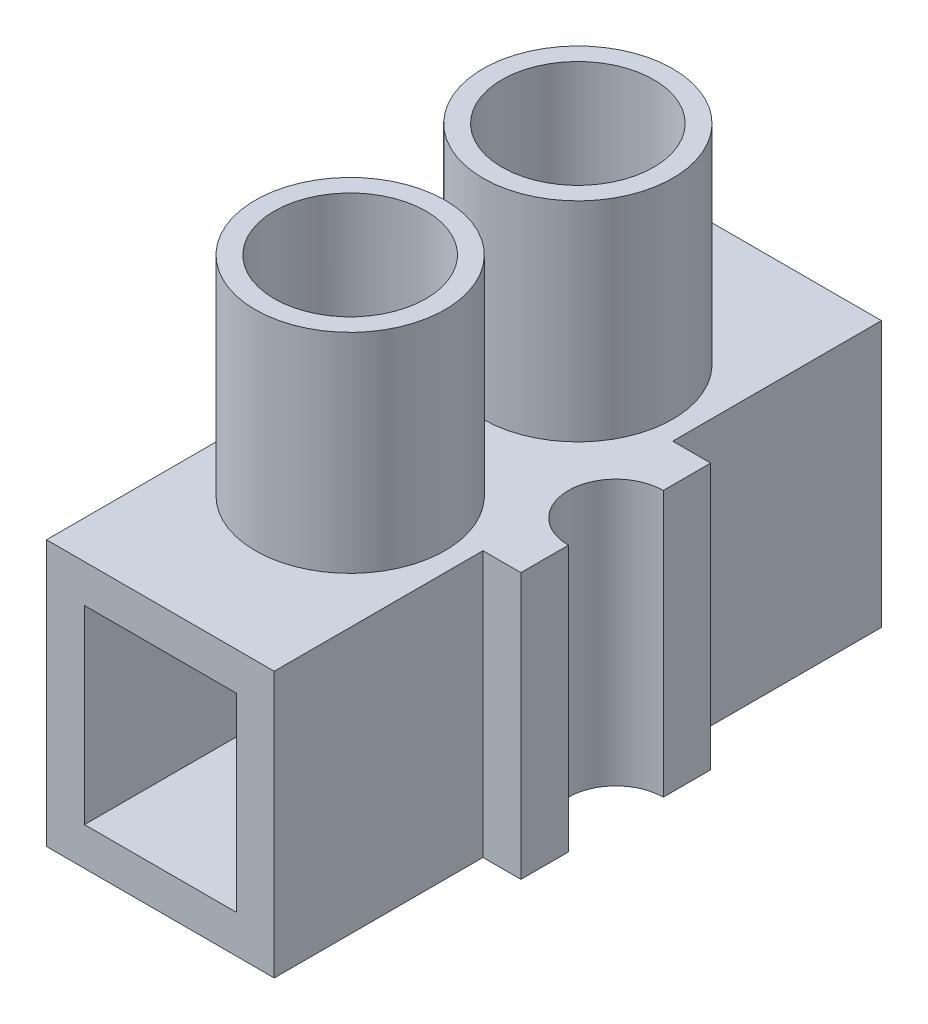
ISO-10303-21;
HEADER;
FILE_DESCRIPTION(('STEP AP214'),'2;1');
FILE_NAME('part.step','',(''),(''),'','','');
FILE_SCHEMA(('AUTOMOTIVE_DESIGN { 1 0 10303 214 1 1 1 1 }'));
ENDSEC;
DATA;
#1=APPLICATION_CONTEXT('core data for automotive mechanical design processes');
#2=APPLICATION_PROTOCOL_DEFINITION('international standard','automotive_design',2000,#1);
#3=PRODUCT_CONTEXT('',#1,'mechanical');
#4=PRODUCT('Part','Part','',(#3));
#5=PRODUCT_RELATED_PRODUCT_CATEGORY('part','',(#4));
#6=PRODUCT_DEFINITION_FORMATION('','',#4);
#7=PRODUCT_DEFINITION_CONTEXT('part definition',#1,'design');
#8=PRODUCT_DEFINITION('design','',#6,#7);
#9=PRODUCT_DEFINITION_SHAPE('','',#8);
#10=(LENGTH_UNIT() NAMED_UNIT(*) SI_UNIT(.MILLI.,.METRE.));
#11=(NAMED_UNIT(*) PLANE_ANGLE_UNIT() SI_UNIT($,.RADIAN.));
#12=(NAMED_UNIT(*) SI_UNIT($,.STERADIAN.) SOLID_ANGLE_UNIT());
#13=UNCERTAINTY_MEASURE_WITH_UNIT(LENGTH_MEASURE(1.E-05),#10,'distance_accuracy_value','');
#14=(GEOMETRIC_REPRESENTATION_CONTEXT(3) GLOBAL_UNCERTAINTY_ASSIGNED_CONTEXT((#13)) GLOBAL_UNIT_ASSIGNED_CONTEXT((#10,
#11,#12)) REPRESENTATION_CONTEXT('',''));
#15=CARTESIAN_POINT('',(0.,0.,0.));
#16=DIRECTION('',(0.,0.,1.));
#17=DIRECTION('',(1.,0.,0.));
#18=AXIS2_PLACEMENT_3D('',#15,#16,#17);
#19=CARTESIAN_POINT('',(3.,7.,-2.5));
#20=DIRECTION('',(-1.,0.,0.));
#21=DIRECTION('',(0.,0.,1.));
#22=AXIS2_PLACEMENT_3D('',#19,#20,#21);
#23=PLANE('',#22);
#24=DIRECTION('',(0.,0.,-1.));
#25=VECTOR('',#24,1.);
#26=CARTESIAN_POINT('',(3.,0.,-2.5));
#27=LINE('',#26,#25);
#28=CARTESIAN_POINT('',(3.,0.,-2.5));
#29=VERTEX_POINT('',#28);
#30=CARTESIAN_POINT('',(3.,0.,-8.));
#31=VERTEX_POINT('',#30);
#32=EDGE_CURVE('E200',#29,#31,#27,.T.);
#33=ORIENTED_EDGE('',*,*,#32,.T.);
#34=DIRECTION('',(0.,-1.,0.));
#35=VECTOR('',#34,1.);
#36=CARTESIAN_POINT('',(3.,7.,-8.));
#37=LINE('',#36,#35);
#38=CARTESIAN_POINT('',(3.,7.,-8.));
#39=VERTEX_POINT('',#38);
#40=EDGE_CURVE('E311',#39,#31,#37,.T.);
#41=ORIENTED_EDGE('',*,*,#40,.F.);
#42=DIRECTION('',(0.,0.,-1.));
#43=VECTOR('',#42,1.);
#44=CARTESIAN_POINT('',(3.,7.,-2.5));
#45=LINE('',#44,#43);
#46=CARTESIAN_POINT('',(3.,7.,-2.5));
#47=VERTEX_POINT('',#46);
#48=EDGE_CURVE('E201',#47,#39,#45,.T.);
#49=ORIENTED_EDGE('',*,*,#48,.F.);
#50=DIRECTION('',(0.,-1.,0.));
#51=VECTOR('',#50,1.);
#52=CARTESIAN_POINT('',(3.,7.,-2.5));
#53=LINE('',#52,#51);
#54=EDGE_CURVE('E235',#47,#29,#53,.T.);
#55=ORIENTED_EDGE('',*,*,#54,.T.);
#56=EDGE_LOOP('',(#33,#41,#49,#55));
#57=FACE_BOUND('',#56,.T.);
#58=ADVANCED_FACE('F37',(#57),#23,.F.);
#59=CARTESIAN_POINT('',(3.,7.,-8.));
#60=DIRECTION('',(0.,0.,1.));
#61=DIRECTION('',(1.,0.,0.));
#62=AXIS2_PLACEMENT_3D('',#59,#60,#61);
#63=PLANE('',#62);
#64=DIRECTION('',(-1.,0.,0.));
#65=VECTOR('',#64,1.);
#66=CARTESIAN_POINT('',(3.,6.,-8.));
#67=LINE('',#66,#65);
#68=CARTESIAN_POINT('',(2.,6.,-8.));
#69=VERTEX_POINT('',#68);
#70=CARTESIAN_POINT('',(-2.,6.,-8.));
#71=VERTEX_POINT('',#70);
#72=EDGE_CURVE('E189',#69,#71,#67,.T.);
#73=ORIENTED_EDGE('',*,*,#72,.T.);
#74=DIRECTION('',(0.,-1.,0.));
#75=VECTOR('',#74,1.);
#76=CARTESIAN_POINT('',(-2.,7.,-8.));
#77=LINE('',#76,#75);
#78=CARTESIAN_POINT('',(-2.,1.,-8.));
#79=VERTEX_POINT('',#78);
#80=EDGE_CURVE('E181',#71,#79,#77,.T.);
#81=ORIENTED_EDGE('',*,*,#80,.T.);
#82=DIRECTION('',(1.,0.,0.));
#83=VECTOR('',#82,1.);
#84=CARTESIAN_POINT('',(3.,1.,-8.));
#85=LINE('',#84,#83);
#86=CARTESIAN_POINT('',(2.,1.,-8.));
#87=VERTEX_POINT('',#86);
#88=EDGE_CURVE('E170',#79,#87,#85,.T.);
#89=ORIENTED_EDGE('',*,*,#88,.T.);
#90=DIRECTION('',(0.,1.,0.));
#91=VECTOR('',#90,1.);
#92=CARTESIAN_POINT('',(2.,7.,-8.));
#93=LINE('',#92,#91);
#94=EDGE_CURVE('E175',#87,#69,#93,.T.);
#95=ORIENTED_EDGE('',*,*,#94,.T.);
#96=EDGE_LOOP('',(#73,#81,#89,#95));
#97=FACE_BOUND('',#96,.T.);
#98=DIRECTION('',(-1.,0.,0.));
#99=VECTOR('',#98,1.);
#100=CARTESIAN_POINT('',(3.,0.,-8.));
#101=LINE('',#100,#99);
#102=CARTESIAN_POINT('',(-3.,0.,-8.));
#103=VERTEX_POINT('',#102);
#104=EDGE_CURVE('E238',#31,#103,#101,.T.);
#105=ORIENTED_EDGE('',*,*,#104,.T.);
#106=DIRECTION('',(0.,-1.,0.));
#107=VECTOR('',#106,1.);
#108=CARTESIAN_POINT('',(-3.,7.,-8.));
#109=LINE('',#108,#107);
#110=CARTESIAN_POINT('',(-3.,7.,-8.));
#111=VERTEX_POINT('',#110);
#112=EDGE_CURVE('E308',#111,#103,#109,.T.);
#113=ORIENTED_EDGE('',*,*,#112,.F.);
#114=DIRECTION('',(-1.,0.,0.));
#115=VECTOR('',#114,1.);
#116=CARTESIAN_POINT('',(3.,7.,-8.));
#117=LINE('',#116,#115);
#118=EDGE_CURVE('E204',#39,#111,#117,.T.);
#119=ORIENTED_EDGE('',*,*,#118,.F.);
#120=ORIENTED_EDGE('',*,*,#40,.T.);
#121=EDGE_LOOP('',(#105,#113,#119,#120));
#122=FACE_BOUND('',#121,.T.);
#123=ADVANCED_FACE('F187',(#97,#122),#63,.F.);
#124=CARTESIAN_POINT('',(-3.,7.,-2.5));
#125=DIRECTION('',(1.,0.,0.));
#126=DIRECTION('',(0.,0.,-1.));
#127=AXIS2_PLACEMENT_3D('',#124,#125,#126);
#128=PLANE('',#127);
#129=DIRECTION('',(0.,0.,1.));
#130=VECTOR('',#129,1.);
#131=CARTESIAN_POINT('',(-3.,0.,-2.5));
#132=LINE('',#131,#130);
#133=CARTESIAN_POINT('',(-3.,0.,-2.5));
#134=VERTEX_POINT('',#133);
#135=EDGE_CURVE('E240',#103,#134,#132,.T.);
#136=ORIENTED_EDGE('',*,*,#135,.T.);
#137=DIRECTION('',(0.,-1.,0.));
#138=VECTOR('',#137,1.);
#139=CARTESIAN_POINT('',(-3.,7.,-2.5));
#140=LINE('',#139,#138);
#141=CARTESIAN_POINT('',(-3.,7.,-2.5));
#142=VERTEX_POINT('',#141);
#143=EDGE_CURVE('E305',#142,#134,#140,.T.);
#144=ORIENTED_EDGE('',*,*,#143,.F.);
#145=DIRECTION('',(0.,0.,1.));
#146=VECTOR('',#145,1.);
#147=CARTESIAN_POINT('',(-3.,7.,-2.5));
#148=LINE('',#147,#146);
#149=EDGE_CURVE('E207',#111,#142,#148,.T.);
#150=ORIENTED_EDGE('',*,*,#149,.F.);
#151=ORIENTED_EDGE('',*,*,#112,.T.);
#152=EDGE_LOOP('',(#136,#144,#150,#151));
#153=FACE_BOUND('',#152,.T.);
#154=ADVANCED_FACE('F358',(#153),#128,.F.);
#155=CARTESIAN_POINT('',(-4.,7.,-2.5));
#156=DIRECTION('',(0.,0.,1.));
#157=DIRECTION('',(1.,0.,0.));
#158=AXIS2_PLACEMENT_3D('',#155,#156,#157);
#159=PLANE('',#158);
#160=DIRECTION('',(-1.,0.,0.));
#161=VECTOR('',#160,1.);
#162=CARTESIAN_POINT('',(-4.,0.,-2.5));
#163=LINE('',#162,#161);
#164=CARTESIAN_POINT('',(-4.,0.,-2.5));
#165=VERTEX_POINT('',#164);
#166=EDGE_CURVE('E242',#134,#165,#163,.T.);
#167=ORIENTED_EDGE('',*,*,#166,.T.);
#168=DIRECTION('',(0.,-1.,0.));
#169=VECTOR('',#168,1.);
#170=CARTESIAN_POINT('',(-4.,7.,-2.5));
#171=LINE('',#170,#169);
#172=CARTESIAN_POINT('',(-4.,7.,-2.5));
#173=VERTEX_POINT('',#172);
#174=EDGE_CURVE('E302',#173,#165,#171,.T.);
#175=ORIENTED_EDGE('',*,*,#174,.F.);
#176=DIRECTION('',(-1.,0.,0.));
#177=VECTOR('',#176,1.);
#178=CARTESIAN_POINT('',(-4.,7.,-2.5));
#179=LINE('',#178,#177);
#180=EDGE_CURVE('E209',#142,#173,#179,.T.);
#181=ORIENTED_EDGE('',*,*,#180,.F.);
#182=ORIENTED_EDGE('',*,*,#143,.T.);
#183=EDGE_LOOP('',(#167,#175,#181,#182));
#184=FACE_BOUND('',#183,.T.);
#185=ADVANCED_FACE('F431',(#184),#159,.F.);
#186=CARTESIAN_POINT('',(-4.,7.,-2.5));
#187=DIRECTION('',(1.,0.,0.));
#188=DIRECTION('',(0.,0.,-1.));
#189=AXIS2_PLACEMENT_3D('',#186,#187,#188);
#190=PLANE('',#189);
#191=DIRECTION('',(0.,0.,1.));
#192=VECTOR('',#191,1.);
#193=CARTESIAN_POINT('',(-4.,0.,-2.5));
#194=LINE('',#193,#192);
#195=CARTESIAN_POINT('',(-4.,0.,-1.25));
#196=VERTEX_POINT('',#195);
#197=EDGE_CURVE('E244',#165,#196,#194,.T.);
#198=ORIENTED_EDGE('',*,*,#197,.T.);
#199=DIRECTION('',(0.,-1.,0.));
#200=VECTOR('',#199,1.);
#201=CARTESIAN_POINT('',(-4.,7.,-1.25));
#202=LINE('',#201,#200);
#203=CARTESIAN_POINT('',(-4.,7.,-1.25));
#204=VERTEX_POINT('',#203);
#205=EDGE_CURVE('E299',#204,#196,#202,.T.);
#206=ORIENTED_EDGE('',*,*,#205,.F.);
#207=DIRECTION('',(0.,0.,1.));
#208=VECTOR('',#207,1.);
#209=CARTESIAN_POINT('',(-4.,7.,-2.5));
#210=LINE('',#209,#208);
#211=EDGE_CURVE('E211',#173,#204,#210,.T.);
#212=ORIENTED_EDGE('',*,*,#211,.F.);
#213=ORIENTED_EDGE('',*,*,#174,.T.);
#214=EDGE_LOOP('',(#198,#206,#212,#213));
#215=FACE_BOUND('',#214,.T.);
#216=ADVANCED_FACE('F426',(#215),#190,.F.);
#217=CARTESIAN_POINT('',(-4.,7.,0.));
#218=DIRECTION('',(0.,-1.,0.));
#219=DIRECTION('',(0.,0.,-1.));
#220=AXIS2_PLACEMENT_3D('',#217,#218,#219);
#221=CYLINDRICAL_SURFACE('',#220,1.25);
#222=CARTESIAN_POINT('',(-4.,0.,0.));
#223=DIRECTION('',(0.,-1.,0.));
#224=DIRECTION('',(0.,0.,-1.));
#225=AXIS2_PLACEMENT_3D('',#222,#223,#224);
#226=CIRCLE('',#225,1.25);
#227=CARTESIAN_POINT('',(-4.,0.,1.25));
#228=VERTEX_POINT('',#227);
#229=EDGE_CURVE('E246',#196,#228,#226,.T.);
#230=ORIENTED_EDGE('',*,*,#229,.T.);
#231=DIRECTION('',(0.,-1.,0.));
#232=VECTOR('',#231,1.);
#233=CARTESIAN_POINT('',(-4.,7.,1.25));
#234=LINE('',#233,#232);
#235=CARTESIAN_POINT('',(-4.,7.,1.25));
#236=VERTEX_POINT('',#235);
#237=EDGE_CURVE('E296',#236,#228,#234,.T.);
#238=ORIENTED_EDGE('',*,*,#237,.F.);
#239=CARTESIAN_POINT('',(-4.,7.,0.));
#240=DIRECTION('',(0.,-1.,0.));
#241=DIRECTION('',(0.,0.,-1.));
#242=AXIS2_PLACEMENT_3D('',#239,#240,#241);
#243=CIRCLE('',#242,1.25);
#244=EDGE_CURVE('E213',#204,#236,#243,.T.);
#245=ORIENTED_EDGE('',*,*,#244,.F.);
#246=ORIENTED_EDGE('',*,*,#205,.T.);
#247=EDGE_LOOP('',(#230,#238,#245,#246));
#248=FACE_BOUND('',#247,.T.);
#249=ADVANCED_FACE('F422',(#248),#221,.F.);
#250=CARTESIAN_POINT('',(-4.,7.,2.5));
#251=DIRECTION('',(1.,0.,0.));
#252=DIRECTION('',(0.,0.,-1.));
#253=AXIS2_PLACEMENT_3D('',#250,#251,#252);
#254=PLANE('',#253);
#255=DIRECTION('',(0.,0.,1.));
#256=VECTOR('',#255,1.);
#257=CARTESIAN_POINT('',(-4.,0.,2.5));
#258=LINE('',#257,#256);
#259=CARTESIAN_POINT('',(-4.,0.,2.5));
#260=VERTEX_POINT('',#259);
#261=EDGE_CURVE('E248',#228,#260,#258,.T.);
#262=ORIENTED_EDGE('',*,*,#261,.T.);
#263=DIRECTION('',(0.,-1.,0.));
#264=VECTOR('',#263,1.);
#265=CARTESIAN_POINT('',(-4.,7.,2.5));
#266=LINE('',#265,#264);
#267=CARTESIAN_POINT('',(-4.,7.,2.5));
#268=VERTEX_POINT('',#267);
#269=EDGE_CURVE('E293',#268,#260,#266,.T.);
#270=ORIENTED_EDGE('',*,*,#269,.F.);
#271=DIRECTION('',(0.,0.,1.));
#272=VECTOR('',#271,1.);
#273=CARTESIAN_POINT('',(-4.,7.,2.5));
#274=LINE('',#273,#272);
#275=EDGE_CURVE('E215',#236,#268,#274,.T.);
#276=ORIENTED_EDGE('',*,*,#275,.F.);
#277=ORIENTED_EDGE('',*,*,#237,.T.);
#278=EDGE_LOOP('',(#262,#270,#276,#277));
#279=FACE_BOUND('',#278,.T.);
#280=ADVANCED_FACE('F418',(#279),#254,.F.);
#281=CARTESIAN_POINT('',(-4.,7.,2.5));
#282=DIRECTION('',(0.,0.,-1.));
#283=DIRECTION('',(-1.,0.,0.));
#284=AXIS2_PLACEMENT_3D('',#281,#282,#283);
#285=PLANE('',#284);
#286=DIRECTION('',(1.,0.,0.));
#287=VECTOR('',#286,1.);
#288=CARTESIAN_POINT('',(-4.,0.,2.5));
#289=LINE('',#288,#287);
#290=CARTESIAN_POINT('',(-3.,0.,2.5));
#291=VERTEX_POINT('',#290);
#292=EDGE_CURVE('E250',#260,#291,#289,.T.);
#293=ORIENTED_EDGE('',*,*,#292,.T.);
#294=DIRECTION('',(0.,-1.,0.));
#295=VECTOR('',#294,1.);
#296=CARTESIAN_POINT('',(-3.,7.,2.5));
#297=LINE('',#296,#295);
#298=CARTESIAN_POINT('',(-3.,7.,2.5));
#299=VERTEX_POINT('',#298);
#300=EDGE_CURVE('E290',#299,#291,#297,.T.);
#301=ORIENTED_EDGE('',*,*,#300,.F.);
#302=DIRECTION('',(1.,0.,0.));
#303=VECTOR('',#302,1.);
#304=CARTESIAN_POINT('',(-4.,7.,2.5));
#305=LINE('',#304,#303);
#306=EDGE_CURVE('E217',#268,#299,#305,.T.);
#307=ORIENTED_EDGE('',*,*,#306,.F.);
#308=ORIENTED_EDGE('',*,*,#269,.T.);
#309=EDGE_LOOP('',(#293,#301,#307,#308));
#310=FACE_BOUND('',#309,.T.);
#311=ADVANCED_FACE('F413',(#310),#285,.F.);
#312=CARTESIAN_POINT('',(-3.,7.,2.5));
#313=DIRECTION('',(1.,0.,0.));
#314=DIRECTION('',(0.,0.,-1.));
#315=AXIS2_PLACEMENT_3D('',#312,#313,#314);
#316=PLANE('',#315);
#317=DIRECTION('',(0.,0.,1.));
#318=VECTOR('',#317,1.);
#319=CARTESIAN_POINT('',(-3.,0.,2.5));
#320=LINE('',#319,#318);
#321=CARTESIAN_POINT('',(-3.,0.,8.));
#322=VERTEX_POINT('',#321);
#323=EDGE_CURVE('E252',#291,#322,#320,.T.);
#324=ORIENTED_EDGE('',*,*,#323,.T.);
#325=DIRECTION('',(0.,-1.,0.));
#326=VECTOR('',#325,1.);
#327=CARTESIAN_POINT('',(-3.,7.,8.));
#328=LINE('',#327,#326);
#329=CARTESIAN_POINT('',(-3.,7.,8.));
#330=VERTEX_POINT('',#329);
#331=EDGE_CURVE('E287',#330,#322,#328,.T.);
#332=ORIENTED_EDGE('',*,*,#331,.F.);
#333=DIRECTION('',(0.,0.,1.));
#334=VECTOR('',#333,1.);
#335=CARTESIAN_POINT('',(-3.,7.,2.5));
#336=LINE('',#335,#334);
#337=EDGE_CURVE('E219',#299,#330,#336,.T.);
#338=ORIENTED_EDGE('',*,*,#337,.F.);
#339=ORIENTED_EDGE('',*,*,#300,.T.);
#340=EDGE_LOOP('',(#324,#332,#338,#339));
#341=FACE_BOUND('',#340,.T.);
#342=ADVANCED_FACE('F407',(#341),#316,.F.);
#343=CARTESIAN_POINT('',(3.,7.,8.));
#344=DIRECTION('',(0.,0.,-1.));
#345=DIRECTION('',(-1.,0.,0.));
#346=AXIS2_PLACEMENT_3D('',#343,#344,#345);
#347=PLANE('',#346);
#348=DIRECTION('',(-1.,0.,0.));
#349=VECTOR('',#348,1.);
#350=CARTESIAN_POINT('',(3.,1.,8.));
#351=LINE('',#350,#349);
#352=CARTESIAN_POINT('',(2.,1.,8.));
#353=VERTEX_POINT('',#352);
#354=CARTESIAN_POINT('',(-2.,1.,8.));
#355=VERTEX_POINT('',#354);
#356=EDGE_CURVE('E320',#353,#355,#351,.T.);
#357=ORIENTED_EDGE('',*,*,#356,.T.);
#358=DIRECTION('',(0.,1.,0.));
#359=VECTOR('',#358,1.);
#360=CARTESIAN_POINT('',(-2.,7.,8.));
#361=LINE('',#360,#359);
#362=CARTESIAN_POINT('',(-2.,6.,8.));
#363=VERTEX_POINT('',#362);
#364=EDGE_CURVE('E11',#355,#363,#361,.T.);
#365=ORIENTED_EDGE('',*,*,#364,.T.);
#366=DIRECTION('',(1.,0.,0.));
#367=VECTOR('',#366,1.);
#368=CARTESIAN_POINT('',(3.,6.,8.));
#369=LINE('',#368,#367);
#370=CARTESIAN_POINT('',(2.,6.,8.));
#371=VERTEX_POINT('',#370);
#372=EDGE_CURVE('E44',#363,#371,#369,.T.);
#373=ORIENTED_EDGE('',*,*,#372,.T.);
#374=DIRECTION('',(0.,-1.,0.));
#375=VECTOR('',#374,1.);
#376=CARTESIAN_POINT('',(2.,7.,8.));
#377=LINE('',#376,#375);
#378=EDGE_CURVE('E322',#371,#353,#377,.T.);
#379=ORIENTED_EDGE('',*,*,#378,.T.);
#380=EDGE_LOOP('',(#357,#365,#373,#379));
#381=FACE_BOUND('',#380,.T.);
#382=DIRECTION('',(1.,0.,0.));
#383=VECTOR('',#382,1.);
#384=CARTESIAN_POINT('',(3.,0.,8.));
#385=LINE('',#384,#383);
#386=CARTESIAN_POINT('',(3.,0.,8.));
#387=VERTEX_POINT('',#386);
#388=EDGE_CURVE('E254',#322,#387,#385,.T.);
#389=ORIENTED_EDGE('',*,*,#388,.T.);
#390=DIRECTION('',(0.,-1.,0.));
#391=VECTOR('',#390,1.);
#392=CARTESIAN_POINT('',(3.,7.,8.));
#393=LINE('',#392,#391);
#394=CARTESIAN_POINT('',(3.,7.,8.));
#395=VERTEX_POINT('',#394);
#396=EDGE_CURVE('E284',#395,#387,#393,.T.);
#397=ORIENTED_EDGE('',*,*,#396,.F.);
#398=DIRECTION('',(1.,0.,0.));
#399=VECTOR('',#398,1.);
#400=CARTESIAN_POINT('',(3.,7.,8.));
#401=LINE('',#400,#399);
#402=EDGE_CURVE('E221',#330,#395,#401,.T.);
#403=ORIENTED_EDGE('',*,*,#402,.F.);
#404=ORIENTED_EDGE('',*,*,#331,.T.);
#405=EDGE_LOOP('',(#389,#397,#403,#404));
#406=FACE_BOUND('',#405,.T.);
#407=ADVANCED_FACE('F326',(#381,#406),#347,.F.);
#408=CARTESIAN_POINT('',(3.,7.,2.5));
#409=DIRECTION('',(-1.,0.,0.));
#410=DIRECTION('',(0.,0.,1.));
#411=AXIS2_PLACEMENT_3D('',#408,#409,#410);
#412=PLANE('',#411);
#413=DIRECTION('',(0.,0.,-1.));
#414=VECTOR('',#413,1.);
#415=CARTESIAN_POINT('',(3.,0.,2.5));
#416=LINE('',#415,#414);
#417=CARTESIAN_POINT('',(3.,0.,2.5));
#418=VERTEX_POINT('',#417);
#419=EDGE_CURVE('E256',#387,#418,#416,.T.);
#420=ORIENTED_EDGE('',*,*,#419,.T.);
#421=DIRECTION('',(0.,-1.,0.));
#422=VECTOR('',#421,1.);
#423=CARTESIAN_POINT('',(3.,7.,2.5));
#424=LINE('',#423,#422);
#425=CARTESIAN_POINT('',(3.,7.,2.5));
#426=VERTEX_POINT('',#425);
#427=EDGE_CURVE('E281',#426,#418,#424,.T.);
#428=ORIENTED_EDGE('',*,*,#427,.F.);
#429=DIRECTION('',(0.,0.,-1.));
#430=VECTOR('',#429,1.);
#431=CARTESIAN_POINT('',(3.,7.,2.5));
#432=LINE('',#431,#430);
#433=EDGE_CURVE('E223',#395,#426,#432,.T.);
#434=ORIENTED_EDGE('',*,*,#433,.F.);
#435=ORIENTED_EDGE('',*,*,#396,.T.);
#436=EDGE_LOOP('',(#420,#428,#434,#435));
#437=FACE_BOUND('',#436,.T.);
#438=ADVANCED_FACE('F400',(#437),#412,.F.);
#439=CARTESIAN_POINT('',(4.,7.,2.5));
#440=DIRECTION('',(0.,0.,-1.));
#441=DIRECTION('',(-1.,0.,0.));
#442=AXIS2_PLACEMENT_3D('',#439,#440,#441);
#443=PLANE('',#442);
#444=DIRECTION('',(1.,0.,0.));
#445=VECTOR('',#444,1.);
#446=CARTESIAN_POINT('',(4.,0.,2.5));
#447=LINE('',#446,#445);
#448=CARTESIAN_POINT('',(4.,0.,2.5));
#449=VERTEX_POINT('',#448);
#450=EDGE_CURVE('E258',#418,#449,#447,.T.);
#451=ORIENTED_EDGE('',*,*,#450,.T.);
#452=DIRECTION('',(0.,-1.,0.));
#453=VECTOR('',#452,1.);
#454=CARTESIAN_POINT('',(4.,7.,2.5));
#455=LINE('',#454,#453);
#456=CARTESIAN_POINT('',(4.,7.,2.5));
#457=VERTEX_POINT('',#456);
#458=EDGE_CURVE('E278',#457,#449,#455,.T.);
#459=ORIENTED_EDGE('',*,*,#458,.F.);
#460=DIRECTION('',(1.,0.,0.));
#461=VECTOR('',#460,1.);
#462=CARTESIAN_POINT('',(4.,7.,2.5));
#463=LINE('',#462,#461);
#464=EDGE_CURVE('E225',#426,#457,#463,.T.);
#465=ORIENTED_EDGE('',*,*,#464,.F.);
#466=ORIENTED_EDGE('',*,*,#427,.T.);
#467=EDGE_LOOP('',(#451,#459,#465,#466));
#468=FACE_BOUND('',#467,.T.);
#469=ADVANCED_FACE('F394',(#468),#443,.F.);
#470=CARTESIAN_POINT('',(4.,7.,2.5));
#471=DIRECTION('',(-1.,0.,0.));
#472=DIRECTION('',(0.,0.,1.));
#473=AXIS2_PLACEMENT_3D('',#470,#471,#472);
#474=PLANE('',#473);
#475=DIRECTION('',(0.,0.,-1.));
#476=VECTOR('',#475,1.);
#477=CARTESIAN_POINT('',(4.,0.,2.5));
#478=LINE('',#477,#476);
#479=CARTESIAN_POINT('',(4.,0.,1.25));
#480=VERTEX_POINT('',#479);
#481=EDGE_CURVE('E260',#449,#480,#478,.T.);
#482=ORIENTED_EDGE('',*,*,#481,.T.);
#483=DIRECTION('',(0.,-1.,0.));
#484=VECTOR('',#483,1.);
#485=CARTESIAN_POINT('',(4.,7.,1.25));
#486=LINE('',#485,#484);
#487=CARTESIAN_POINT('',(4.,7.,1.25));
#488=VERTEX_POINT('',#487);
#489=EDGE_CURVE('E275',#488,#480,#486,.T.);
#490=ORIENTED_EDGE('',*,*,#489,.F.);
#491=DIRECTION('',(0.,0.,-1.));
#492=VECTOR('',#491,1.);
#493=CARTESIAN_POINT('',(4.,7.,2.5));
#494=LINE('',#493,#492);
#495=EDGE_CURVE('E227',#457,#488,#494,.T.);
#496=ORIENTED_EDGE('',*,*,#495,.F.);
#497=ORIENTED_EDGE('',*,*,#458,.T.);
#498=EDGE_LOOP('',(#482,#490,#496,#497));
#499=FACE_BOUND('',#498,.T.);
#500=ADVANCED_FACE('F390',(#499),#474,.F.);
#501=CARTESIAN_POINT('',(4.,7.,0.));
#502=DIRECTION('',(0.,-1.,0.));
#503=DIRECTION('',(0.,0.,-1.));
#504=AXIS2_PLACEMENT_3D('',#501,#502,#503);
#505=CYLINDRICAL_SURFACE('',#504,1.25);
#506=CARTESIAN_POINT('',(4.,0.,0.));
#507=DIRECTION('',(0.,-1.,0.));
#508=DIRECTION('',(0.,0.,1.));
#509=AXIS2_PLACEMENT_3D('',#506,#507,#508);
#510=CIRCLE('',#509,1.25);
#511=CARTESIAN_POINT('',(4.,0.,-1.25));
#512=VERTEX_POINT('',#511);
#513=EDGE_CURVE('E262',#480,#512,#510,.T.);
#514=ORIENTED_EDGE('',*,*,#513,.T.);
#515=DIRECTION('',(0.,-1.,0.));
#516=VECTOR('',#515,1.);
#517=CARTESIAN_POINT('',(4.,7.,-1.25));
#518=LINE('',#517,#516);
#519=CARTESIAN_POINT('',(4.,7.,-1.25));
#520=VERTEX_POINT('',#519);
#521=EDGE_CURVE('E272',#520,#512,#518,.T.);
#522=ORIENTED_EDGE('',*,*,#521,.F.);
#523=CARTESIAN_POINT('',(4.,7.,0.));
#524=DIRECTION('',(0.,-1.,0.));
#525=DIRECTION('',(0.,0.,1.));
#526=AXIS2_PLACEMENT_3D('',#523,#524,#525);
#527=CIRCLE('',#526,1.25);
#528=EDGE_CURVE('E229',#488,#520,#527,.T.);
#529=ORIENTED_EDGE('',*,*,#528,.F.);
#530=ORIENTED_EDGE('',*,*,#489,.T.);
#531=EDGE_LOOP('',(#514,#522,#529,#530));
#532=FACE_BOUND('',#531,.T.);
#533=ADVANCED_FACE('F385',(#532),#505,.F.);
#534=CARTESIAN_POINT('',(4.,7.,-2.5));
#535=DIRECTION('',(-1.,0.,0.));
#536=DIRECTION('',(0.,0.,1.));
#537=AXIS2_PLACEMENT_3D('',#534,#535,#536);
#538=PLANE('',#537);
#539=DIRECTION('',(0.,0.,-1.));
#540=VECTOR('',#539,1.);
#541=CARTESIAN_POINT('',(4.,0.,-2.5));
#542=LINE('',#541,#540);
#543=CARTESIAN_POINT('',(4.,0.,-2.5));
#544=VERTEX_POINT('',#543);
#545=EDGE_CURVE('E264',#512,#544,#542,.T.);
#546=ORIENTED_EDGE('',*,*,#545,.T.);
#547=DIRECTION('',(0.,-1.,0.));
#548=VECTOR('',#547,1.);
#549=CARTESIAN_POINT('',(4.,7.,-2.5));
#550=LINE('',#549,#548);
#551=CARTESIAN_POINT('',(4.,7.,-2.5));
#552=VERTEX_POINT('',#551);
#553=EDGE_CURVE('E269',#552,#544,#550,.T.);
#554=ORIENTED_EDGE('',*,*,#553,.F.);
#555=DIRECTION('',(0.,0.,-1.));
#556=VECTOR('',#555,1.);
#557=CARTESIAN_POINT('',(4.,7.,-2.5));
#558=LINE('',#557,#556);
#559=EDGE_CURVE('E231',#520,#552,#558,.T.);
#560=ORIENTED_EDGE('',*,*,#559,.F.);
#561=ORIENTED_EDGE('',*,*,#521,.T.);
#562=EDGE_LOOP('',(#546,#554,#560,#561));
#563=FACE_BOUND('',#562,.T.);
#564=ADVANCED_FACE('F379',(#563),#538,.F.);
#565=CARTESIAN_POINT('',(4.,7.,-2.5));
#566=DIRECTION('',(0.,0.,1.));
#567=DIRECTION('',(1.,0.,0.));
#568=AXIS2_PLACEMENT_3D('',#565,#566,#567);
#569=PLANE('',#568);
#570=DIRECTION('',(-1.,0.,0.));
#571=VECTOR('',#570,1.);
#572=CARTESIAN_POINT('',(4.,0.,-2.5));
#573=LINE('',#572,#571);
#574=EDGE_CURVE('E205',#544,#29,#573,.T.);
#575=ORIENTED_EDGE('',*,*,#574,.T.);
#576=ORIENTED_EDGE('',*,*,#54,.F.);
#577=DIRECTION('',(-1.,0.,0.));
#578=VECTOR('',#577,1.);
#579=CARTESIAN_POINT('',(4.,7.,-2.5));
#580=LINE('',#579,#578);
#581=EDGE_CURVE('E233',#552,#47,#580,.T.);
#582=ORIENTED_EDGE('',*,*,#581,.F.);
#583=ORIENTED_EDGE('',*,*,#553,.T.);
#584=EDGE_LOOP('',(#575,#576,#582,#583));
#585=FACE_BOUND('',#584,.T.);
#586=ADVANCED_FACE('F377',(#585),#569,.F.);
#587=CARTESIAN_POINT('',(-4.,7.,0.));
#588=DIRECTION('',(0.,-1.,0.));
#589=DIRECTION('',(0.,0.,-1.));
#590=AXIS2_PLACEMENT_3D('',#587,#588,#589);
#591=PLANE('',#590);
#592=CARTESIAN_POINT('',(0.,7.,3.));
#593=DIRECTION('',(0.,-1.,0.));
#594=DIRECTION('',(0.,0.,-1.));
#595=AXIS2_PLACEMENT_3D('',#592,#593,#594);
#596=CIRCLE('',#595,2.5);
#597=CARTESIAN_POINT('',(0.,7.,0.499999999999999));
#598=VERTEX_POINT('',#597);
#599=EDGE_CURVE('E317',#598,#598,#596,.F.);
#600=ORIENTED_EDGE('',*,*,#599,.F.);
#601=EDGE_LOOP('',(#600));
#602=FACE_BOUND('',#601,.T.);
#603=CARTESIAN_POINT('',(0.,7.,-3.));
#604=DIRECTION('',(0.,-1.,0.));
#605=DIRECTION('',(0.,0.,-1.));
#606=AXIS2_PLACEMENT_3D('',#603,#604,#605);
#607=CIRCLE('',#606,2.5);
#608=CARTESIAN_POINT('',(0.,7.,-5.5));
#609=VERTEX_POINT('',#608);
#610=EDGE_CURVE('E314',#609,#609,#607,.F.);
#611=ORIENTED_EDGE('',*,*,#610,.F.);
#612=EDGE_LOOP('',(#611));
#613=FACE_BOUND('',#612,.T.);
#614=ORIENTED_EDGE('',*,*,#48,.T.);
#615=ORIENTED_EDGE('',*,*,#118,.T.);
#616=ORIENTED_EDGE('',*,*,#149,.T.);
#617=ORIENTED_EDGE('',*,*,#180,.T.);
#618=ORIENTED_EDGE('',*,*,#211,.T.);
#619=ORIENTED_EDGE('',*,*,#244,.T.);
#620=ORIENTED_EDGE('',*,*,#275,.T.);
#621=ORIENTED_EDGE('',*,*,#306,.T.);
#622=ORIENTED_EDGE('',*,*,#337,.T.);
#623=ORIENTED_EDGE('',*,*,#402,.T.);
#624=ORIENTED_EDGE('',*,*,#433,.T.);
#625=ORIENTED_EDGE('',*,*,#464,.T.);
#626=ORIENTED_EDGE('',*,*,#495,.T.);
#627=ORIENTED_EDGE('',*,*,#528,.T.);
#628=ORIENTED_EDGE('',*,*,#559,.T.);
#629=ORIENTED_EDGE('',*,*,#581,.T.);
#630=EDGE_LOOP('',(#614,#615,#616,#617,#618,#619,#620,#621,#622,#623,#624,#625,#626,#627,#628,#629));
#631=FACE_BOUND('',#630,.T.);
#632=ADVANCED_FACE('F372',(#602,#613,#631),#591,.F.);
#633=CARTESIAN_POINT('',(-4.,0.,0.));
#634=DIRECTION('',(0.,-1.,0.));
#635=DIRECTION('',(0.,0.,-1.));
#636=AXIS2_PLACEMENT_3D('',#633,#634,#635);
#637=PLANE('',#636);
#638=ORIENTED_EDGE('',*,*,#32,.F.);
#639=ORIENTED_EDGE('',*,*,#574,.F.);
#640=ORIENTED_EDGE('',*,*,#545,.F.);
#641=ORIENTED_EDGE('',*,*,#513,.F.);
#642=ORIENTED_EDGE('',*,*,#481,.F.);
#643=ORIENTED_EDGE('',*,*,#450,.F.);
#644=ORIENTED_EDGE('',*,*,#419,.F.);
#645=ORIENTED_EDGE('',*,*,#388,.F.);
#646=ORIENTED_EDGE('',*,*,#323,.F.);
#647=ORIENTED_EDGE('',*,*,#292,.F.);
#648=ORIENTED_EDGE('',*,*,#261,.F.);
#649=ORIENTED_EDGE('',*,*,#229,.F.);
#650=ORIENTED_EDGE('',*,*,#197,.F.);
#651=ORIENTED_EDGE('',*,*,#166,.F.);
#652=ORIENTED_EDGE('',*,*,#135,.F.);
#653=ORIENTED_EDGE('',*,*,#104,.F.);
#654=EDGE_LOOP('',(#638,#639,#640,#641,#642,#643,#644,#645,#646,#647,#648,#649,#650,#651,#652,#653));
#655=FACE_BOUND('',#654,.T.);
#656=ADVANCED_FACE('F365',(#655),#637,.T.);
#657=CARTESIAN_POINT('',(0.,12.5,-3.));
#658=DIRECTION('',(0.,-1.,0.));
#659=DIRECTION('',(0.,0.,-1.));
#660=AXIS2_PLACEMENT_3D('',#657,#658,#659);
#661=CYLINDRICAL_SURFACE('',#660,2.5);
#662=CARTESIAN_POINT('',(0.,12.5,-3.));
#663=DIRECTION('',(0.,1.,0.));
#664=DIRECTION('',(0.,0.,1.));
#665=AXIS2_PLACEMENT_3D('',#662,#663,#664);
#666=CIRCLE('',#665,2.5);
#667=CARTESIAN_POINT('',(0.,12.5,-0.499999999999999));
#668=VERTEX_POINT('',#667);
#669=EDGE_CURVE('E193',#668,#668,#666,.T.);
#670=ORIENTED_EDGE('',*,*,#669,.F.);
#671=EDGE_LOOP('',(#670));
#672=FACE_BOUND('',#671,.T.);
#673=ORIENTED_EDGE('',*,*,#610,.T.);
#674=EDGE_LOOP('',(#673));
#675=FACE_BOUND('',#674,.T.);
#676=ADVANCED_FACE('F466',(#672,#675),#661,.T.);
#677=CARTESIAN_POINT('',(0.,12.5,-3.));
#678=DIRECTION('',(0.,1.,0.));
#679=DIRECTION('',(0.,0.,1.));
#680=AXIS2_PLACEMENT_3D('',#677,#678,#679);
#681=PLANE('',#680);
#682=CARTESIAN_POINT('',(0.,12.5,-3.));
#683=DIRECTION('',(0.,1.,0.));
#684=DIRECTION('',(0.,0.,1.));
#685=AXIS2_PLACEMENT_3D('',#682,#683,#684);
#686=CIRCLE('',#685,1.99990492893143);
#687=CARTESIAN_POINT('',(0.,12.5,-1.00009507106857));
#688=VERTEX_POINT('',#687);
#689=EDGE_CURVE('E596',#688,#688,#686,.T.);
#690=ORIENTED_EDGE('',*,*,#689,.F.);
#691=EDGE_LOOP('',(#690));
#692=FACE_BOUND('',#691,.T.);
#693=ORIENTED_EDGE('',*,*,#669,.T.);
#694=EDGE_LOOP('',(#693));
#695=FACE_BOUND('',#694,.T.);
#696=ADVANCED_FACE('F472',(#692,#695),#681,.T.);
#697=CARTESIAN_POINT('',(0.,12.5,3.));
#698=DIRECTION('',(0.,-1.,0.));
#699=DIRECTION('',(0.,0.,-1.));
#700=AXIS2_PLACEMENT_3D('',#697,#698,#699);
#701=CYLINDRICAL_SURFACE('',#700,2.5);
#702=CARTESIAN_POINT('',(0.,12.5,3.));
#703=DIRECTION('',(0.,1.,0.));
#704=DIRECTION('',(0.,0.,-1.));
#705=AXIS2_PLACEMENT_3D('',#702,#703,#704);
#706=CIRCLE('',#705,2.5);
#707=CARTESIAN_POINT('',(0.,12.5,0.499999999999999));
#708=VERTEX_POINT('',#707);
#709=EDGE_CURVE('E190',#708,#708,#706,.T.);
#710=ORIENTED_EDGE('',*,*,#709,.F.);
#711=EDGE_LOOP('',(#710));
#712=FACE_BOUND('',#711,.T.);
#713=ORIENTED_EDGE('',*,*,#599,.T.);
#714=EDGE_LOOP('',(#713));
#715=FACE_BOUND('',#714,.T.);
#716=ADVANCED_FACE('F475',(#712,#715),#701,.T.);
#717=CARTESIAN_POINT('',(0.,12.5,3.));
#718=DIRECTION('',(0.,-1.,0.));
#719=DIRECTION('',(0.,0.,-1.));
#720=AXIS2_PLACEMENT_3D('',#717,#718,#719);
#721=PLANE('',#720);
#722=CARTESIAN_POINT('',(0.,12.5,3.));
#723=DIRECTION('',(0.,1.,0.));
#724=DIRECTION('',(0.,0.,-1.));
#725=AXIS2_PLACEMENT_3D('',#722,#723,#724);
#726=CIRCLE('',#725,1.99990492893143);
#727=CARTESIAN_POINT('',(0.,12.5,1.00009507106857));
#728=VERTEX_POINT('',#727);
#729=EDGE_CURVE('E603',#728,#728,#726,.T.);
#730=ORIENTED_EDGE('',*,*,#729,.F.);
#731=EDGE_LOOP('',(#730));
#732=FACE_BOUND('',#731,.T.);
#733=ORIENTED_EDGE('',*,*,#709,.T.);
#734=EDGE_LOOP('',(#733));
#735=FACE_BOUND('',#734,.T.);
#736=ADVANCED_FACE('F479',(#732,#735),#721,.F.);
#737=CARTESIAN_POINT('',(-2.,6.,-12.75));
#738=DIRECTION('',(-1.,0.,0.));
#739=DIRECTION('',(0.,0.,1.));
#740=AXIS2_PLACEMENT_3D('',#737,#738,#739);
#741=PLANE('',#740);
#742=DIRECTION('',(0.,0.,1.));
#743=VECTOR('',#742,1.);
#744=CARTESIAN_POINT('',(-2.,6.,-12.75));
#745=LINE('',#744,#743);
#746=EDGE_CURVE('E176',#71,#363,#745,.T.);
#747=ORIENTED_EDGE('',*,*,#746,.T.);
#748=ORIENTED_EDGE('',*,*,#364,.F.);
#749=DIRECTION('',(0.,0.,1.));
#750=VECTOR('',#749,1.);
#751=CARTESIAN_POINT('',(-2.,1.,-12.75));
#752=LINE('',#751,#750);
#753=EDGE_CURVE('E56',#79,#355,#752,.T.);
#754=ORIENTED_EDGE('',*,*,#753,.F.);
#755=ORIENTED_EDGE('',*,*,#80,.F.);
#756=EDGE_LOOP('',(#747,#748,#754,#755));
#757=FACE_BOUND('',#756,.T.);
#758=ADVANCED_FACE('F180',(#757),#741,.F.);
#759=CARTESIAN_POINT('',(-2.,6.,-12.75));
#760=DIRECTION('',(0.,1.,0.));
#761=DIRECTION('',(0.,0.,1.));
#762=AXIS2_PLACEMENT_3D('',#759,#760,#761);
#763=PLANE('',#762);
#764=CARTESIAN_POINT('',(0.,6.,-3.));
#765=DIRECTION('',(0.,1.,0.));
#766=DIRECTION('',(0.,0.,1.));
#767=AXIS2_PLACEMENT_3D('',#764,#765,#766);
#768=CIRCLE('',#767,1.99990492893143);
#769=CARTESIAN_POINT('',(0.,6.,-1.00009507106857));
#770=VERTEX_POINT('',#769);
#771=EDGE_CURVE('E184',#770,#770,#768,.T.);
#772=ORIENTED_EDGE('',*,*,#771,.T.);
#773=EDGE_LOOP('',(#772));
#774=FACE_BOUND('',#773,.T.);
#775=CARTESIAN_POINT('',(0.,6.,3.));
#776=DIRECTION('',(0.,1.,0.));
#777=DIRECTION('',(0.,0.,1.));
#778=AXIS2_PLACEMENT_3D('',#775,#776,#777);
#779=CIRCLE('',#778,1.99990492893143);
#780=CARTESIAN_POINT('',(0.,6.,4.99990492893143));
#781=VERTEX_POINT('',#780);
#782=EDGE_CURVE('E599',#781,#781,#779,.T.);
#783=ORIENTED_EDGE('',*,*,#782,.T.);
#784=EDGE_LOOP('',(#783));
#785=FACE_BOUND('',#784,.T.);
#786=DIRECTION('',(0.,0.,1.));
#787=VECTOR('',#786,1.);
#788=CARTESIAN_POINT('',(2.,6.,-12.75));
#789=LINE('',#788,#787);
#790=EDGE_CURVE('E332',#69,#371,#789,.T.);
#791=ORIENTED_EDGE('',*,*,#790,.T.);
#792=ORIENTED_EDGE('',*,*,#372,.F.);
#793=ORIENTED_EDGE('',*,*,#746,.F.);
#794=ORIENTED_EDGE('',*,*,#72,.F.);
#795=EDGE_LOOP('',(#791,#792,#793,#794));
#796=FACE_BOUND('',#795,.T.);
#797=ADVANCED_FACE('F330',(#774,#785,#796),#763,.F.);
#798=CARTESIAN_POINT('',(2.,6.,-12.75));
#799=DIRECTION('',(1.,0.,0.));
#800=DIRECTION('',(0.,0.,-1.));
#801=AXIS2_PLACEMENT_3D('',#798,#799,#800);
#802=PLANE('',#801);
#803=DIRECTION('',(0.,0.,1.));
#804=VECTOR('',#803,1.);
#805=CARTESIAN_POINT('',(2.,1.,-12.75));
#806=LINE('',#805,#804);
#807=EDGE_CURVE('E51',#87,#353,#806,.T.);
#808=ORIENTED_EDGE('',*,*,#807,.T.);
#809=ORIENTED_EDGE('',*,*,#378,.F.);
#810=ORIENTED_EDGE('',*,*,#790,.F.);
#811=ORIENTED_EDGE('',*,*,#94,.F.);
#812=EDGE_LOOP('',(#808,#809,#810,#811));
#813=FACE_BOUND('',#812,.T.);
#814=ADVANCED_FACE('F339',(#813),#802,.F.);
#815=CARTESIAN_POINT('',(-2.,1.,-12.75));
#816=DIRECTION('',(0.,-1.,0.));
#817=DIRECTION('',(0.,0.,-1.));
#818=AXIS2_PLACEMENT_3D('',#815,#816,#817);
#819=PLANE('',#818);
#820=ORIENTED_EDGE('',*,*,#753,.T.);
#821=ORIENTED_EDGE('',*,*,#356,.F.);
#822=ORIENTED_EDGE('',*,*,#807,.F.);
#823=ORIENTED_EDGE('',*,*,#88,.F.);
#824=EDGE_LOOP('',(#820,#821,#822,#823));
#825=FACE_BOUND('',#824,.T.);
#826=ADVANCED_FACE('F171',(#825),#819,.F.);
#827=CARTESIAN_POINT('',(0.,-4.65658534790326,3.));
#828=DIRECTION('',(0.,1.,0.));
#829=DIRECTION('',(0.,0.,1.));
#830=AXIS2_PLACEMENT_3D('',#827,#828,#829);
#831=CYLINDRICAL_SURFACE('',#830,1.99990492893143);
#832=ORIENTED_EDGE('',*,*,#729,.T.);
#833=EDGE_LOOP('',(#832));
#834=FACE_BOUND('',#833,.T.);
#835=ORIENTED_EDGE('',*,*,#782,.F.);
#836=EDGE_LOOP('',(#835));
#837=FACE_BOUND('',#836,.T.);
#838=ADVANCED_FACE('F347',(#834,#837),#831,.F.);
#839=CARTESIAN_POINT('',(0.,-4.65658534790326,-3.));
#840=DIRECTION('',(0.,1.,0.));
#841=DIRECTION('',(0.,0.,1.));
#842=AXIS2_PLACEMENT_3D('',#839,#840,#841);
#843=CYLINDRICAL_SURFACE('',#842,1.99990492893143);
#844=ORIENTED_EDGE('',*,*,#689,.T.);
#845=EDGE_LOOP('',(#844));
#846=FACE_BOUND('',#845,.T.);
#847=ORIENTED_EDGE('',*,*,#771,.F.);
#848=EDGE_LOOP('',(#847));
#849=FACE_BOUND('',#848,.T.);
#850=ADVANCED_FACE('F582',(#846,#849),#843,.F.);
#851=CLOSED_SHELL('',(#58,#123,#154,#185,#216,#249,#280,#311,#342,#407,#438,#469,#500,#533,#564,
#586,#632,#656,#676,#696,#716,#736,#758,#797,#814,#826,#838,#850));
#852=MANIFOLD_SOLID_BREP('B2',#851);
#853=ADVANCED_BREP_SHAPE_REPRESENTATION('',(#18,#852),#14);
#854=SHAPE_DEFINITION_REPRESENTATION(#9,#853);
ENDSEC;
END-ISO-10303-21;
